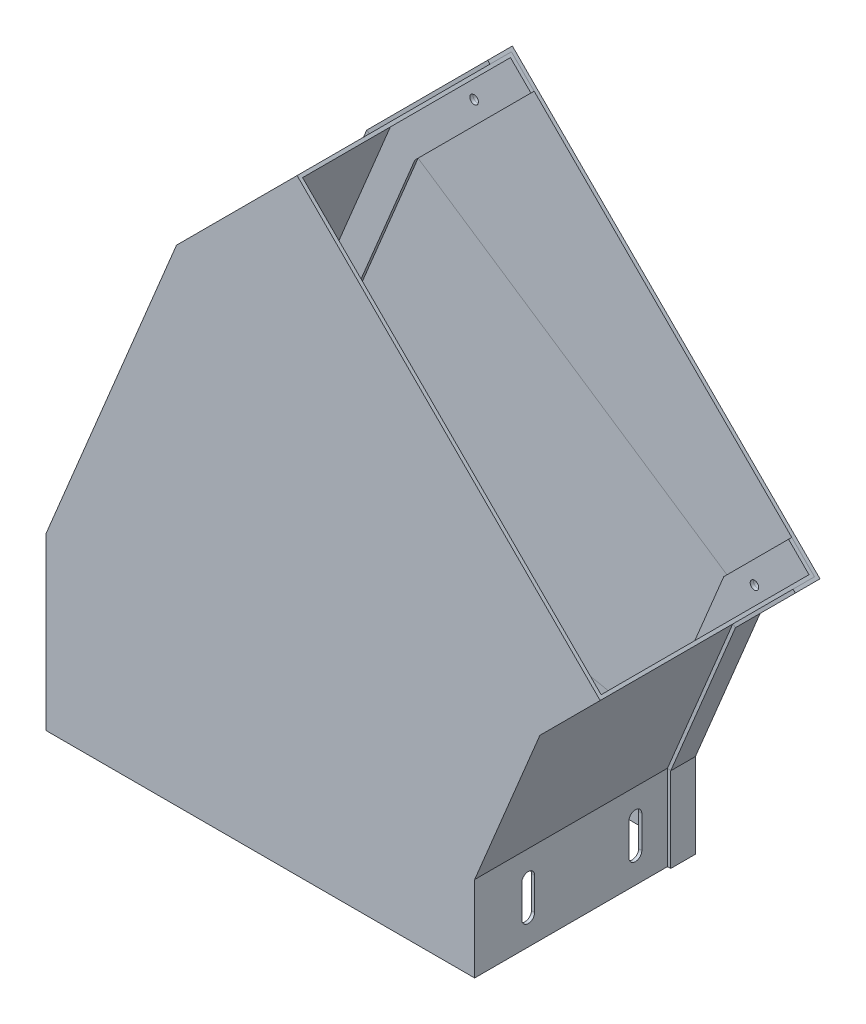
from build123d import *

# Parameters (mm, degrees)
CUT_EXTRUDE1_DEPTH      = 329.096306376
CUT_EXTRUDE1_DEPTH_BACK = 329.096306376
CUT_EXTRUDE2_DEPTH      = 288.740112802
CUT_EXTRUDE2_DEPTH_BACK = 288.740112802
SKETCH4_R               = 2
CUT_EXTRUDE3_DEPTH      = 493.44289009
CUT_EXTRUDE4_REACH      = 494.443
SKETCH5_R               = 2
SKETCH10_R              = 2
CUT_EXTRUDE5_DEPTH      = 495.424539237
SKETCH11_R              = 2
CUT_EXTRUDE6_DEPTH      = 495.424539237


with BuildPart() as part:
    # Sweep1: sweep along a path in ElbowArc
    with BuildLine(Plane.XY) as sweep1_path:
        Line((-300, 0), (-300, 59.673710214))
        Line((-300, 59.673710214), (-254.327719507, 169.936349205))
        Line((-254.327719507, 169.936349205), (-212.132034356, 212.132034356))
    # Sketch1 → Sweep1 (sweep)
    with BuildSketch(Plane(origin=(0, 0, 0), x_dir=(1, 0, 0), z_dir=(0, 1, 0))):
        Polygon((-200, -50), (-400, -50), (-400, 50), (-385, 50), (-385, 48.5), (-398.5, 48.5), (-398.5, -48.5), (-201.5, -48.5), (-201.5, 48.5), (-215, 48.5), (-215, 50), (-200, 50), align=None)
    sweep(path=sweep1_path.line, transition=Transition.RIGHT)

    # Sketch2 → Cut-Extrude1 (cut, two sides: drawn at the far end of the back side and taken through both)
    with BuildSketch(Plane(origin=(-300, 0, 0), x_dir=(0, 0, -1), z_dir=(1, 0, 0)).offset(-CUT_EXTRUDE1_DEPTH_BACK)):
        with BuildLine():
            Line((-28, 12.5), (-28, 27.5))
            ThreePointArc((-28, 27.5), (-25, 30.5), (-22, 27.5))
            Line((-22, 27.5), (-22, 12.5))
            ThreePointArc((-22, 12.5), (-25, 9.5), (-28, 12.5))
        make_face()
        with BuildLine():
            Line((22, 12.5), (22, 27.5))
            ThreePointArc((22, 27.5), (25, 30.5), (28, 27.5))
            Line((28, 27.5), (28, 12.5))
            ThreePointArc((28, 12.5), (25, 9.5), (22, 12.5))
        make_face()
    extrude(amount=CUT_EXTRUDE1_DEPTH + CUT_EXTRUDE1_DEPTH_BACK, mode=Mode.SUBTRACT)

    # Sketch3 → Cut-Extrude2 (cut, two sides: drawn at the far end of the back side and taken through both)
    with BuildSketch(Plane(origin=(-212.132034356, 212.132034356, 0), x_dir=(-0.7071067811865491, -0.7071067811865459, 0), z_dir=(-0.7071067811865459, 0.7071067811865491, 3.4914813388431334e-15)).offset(-CUT_EXTRUDE2_DEPTH_BACK)):
        with BuildLine():
            Line((12.5, 28), (27.5, 28))
            ThreePointArc((27.5, 28), (30.5, 25), (27.5, 22))
            Line((27.5, 22), (12.5, 22))
            ThreePointArc((12.5, 22), (9.5, 25), (12.5, 28))
        make_face()
        with BuildLine():
            Line((12.5, -22), (27.5, -22))
            ThreePointArc((27.5, -22), (30.5, -25), (27.5, -28))
            Line((27.5, -28), (12.5, -28))
            ThreePointArc((12.5, -28), (9.5, -25), (12.5, -22))
        make_face()
    extrude(amount=CUT_EXTRUDE2_DEPTH + CUT_EXTRUDE2_DEPTH_BACK, mode=Mode.SUBTRACT)

    # Sketch4 → Cut-Extrude3 (cut, through all)
    with BuildSketch(Plane(origin=(0, 0, 0), x_dir=(-1, 0, 0), z_dir=(0, 0, -1))):
        with Locations((392.5, 30)):
            Circle(SKETCH4_R)
        with Locations((207.5, 30)):
            Circle(SKETCH4_R)
    extrude(amount=CUT_EXTRUDE3_DEPTH, mode=Mode.SUBTRACT)

    # Sketch5 → Cut-Extrude4 (cut, up to next)
    with BuildSketch(Plane(origin=(0, 0, 0), x_dir=(0.7071067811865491, 0.7071067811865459, 0), z_dir=(0, 0, 1)), mode=Mode.PRIVATE) as cut_extrude4_sk1:
        with Locations(Location((-30, 392.5, 0), (0, 0, 315))):
            Circle(SKETCH5_R)
    cut_extrude4_tool1 = extrude(cut_extrude4_sk1.sketch, amount=-CUT_EXTRUDE4_REACH, mode=Mode.PRIVATE) & part.part
    # Sketch5 → Cut-Extrude4 (cut, up to next)
    with BuildSketch(Plane(origin=(0, 0, 0), x_dir=(0.7071067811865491, 0.7071067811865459, 0), z_dir=(0, 0, 1)), mode=Mode.PRIVATE) as cut_extrude4_sk2:
        with Locations(Location((-30, 207.5, 0), (0, 0, 315))):
            Circle(SKETCH5_R)
    cut_extrude4_tool2 = extrude(cut_extrude4_sk2.sketch, amount=-CUT_EXTRUDE4_REACH, mode=Mode.PRIVATE) & part.part
    add(cut_extrude4_tool1.solids().sort_by_distance((-298.752615, 256.326208, 0))[0], mode=Mode.SUBTRACT)
    add(cut_extrude4_tool2.solids().sort_by_distance((-167.937861, 125.511454, 0))[0], mode=Mode.SUBTRACT)


with BuildPart() as body_2:
    # Sweep2: sweep along a path in ElbowArc_2
    with BuildLine(Plane.XY) as sweep2_path:
        Line((-300, 0), (-300, 59.673710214))
        Line((-300, 59.673710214), (-254.327719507, 169.936349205))
        Line((-254.327719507, 169.936349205), (-212.132034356, 212.132034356))
    # Sketch8 → Sweep2 (sweep)
    with BuildSketch(Plane(origin=(0, 0, 0), x_dir=(1, 0, 0), z_dir=(0, 1, 0))):
        Polygon((-400, 40), (-400, 50), (-200, 50), (-200, 40), (-198.5, 40), (-198.5, 51.5), (-401.5, 51.5), (-401.5, 40), align=None)
    sweep(path=sweep2_path.line, transition=Transition.RIGHT)

    # Sketch10 → Cut-Extrude5 (cut, through all)
    with BuildSketch(Plane(origin=(0, 0, 0), x_dir=(0, 1, 0), z_dir=(0, 0, 1))):
        with Locations(Location((30, 207.5, 0), (0, 0, 270))):
            Circle(SKETCH10_R)
        with Locations(Location((30, 392.5, 0), (0, 0, 270))):
            Circle(SKETCH10_R)
    extrude(amount=-CUT_EXTRUDE5_DEPTH, mode=Mode.SUBTRACT)

    # Sketch11 → Cut-Extrude6 (cut, through all)
    with BuildSketch(Plane(origin=(0, 0, 0), x_dir=(0.7071067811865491, 0.7071067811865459, 0), z_dir=(0, 0, 1))):
        with Locations(Location((-30, 207.5, 0), (0, 0, 315))):
            Circle(SKETCH11_R)
        with Locations(Location((-30, 392.5, 0), (0, 0, 315))):
            Circle(SKETCH11_R)
    extrude(amount=-CUT_EXTRUDE6_DEPTH, mode=Mode.SUBTRACT)


solid = Compound([part.part, body_2.part])
